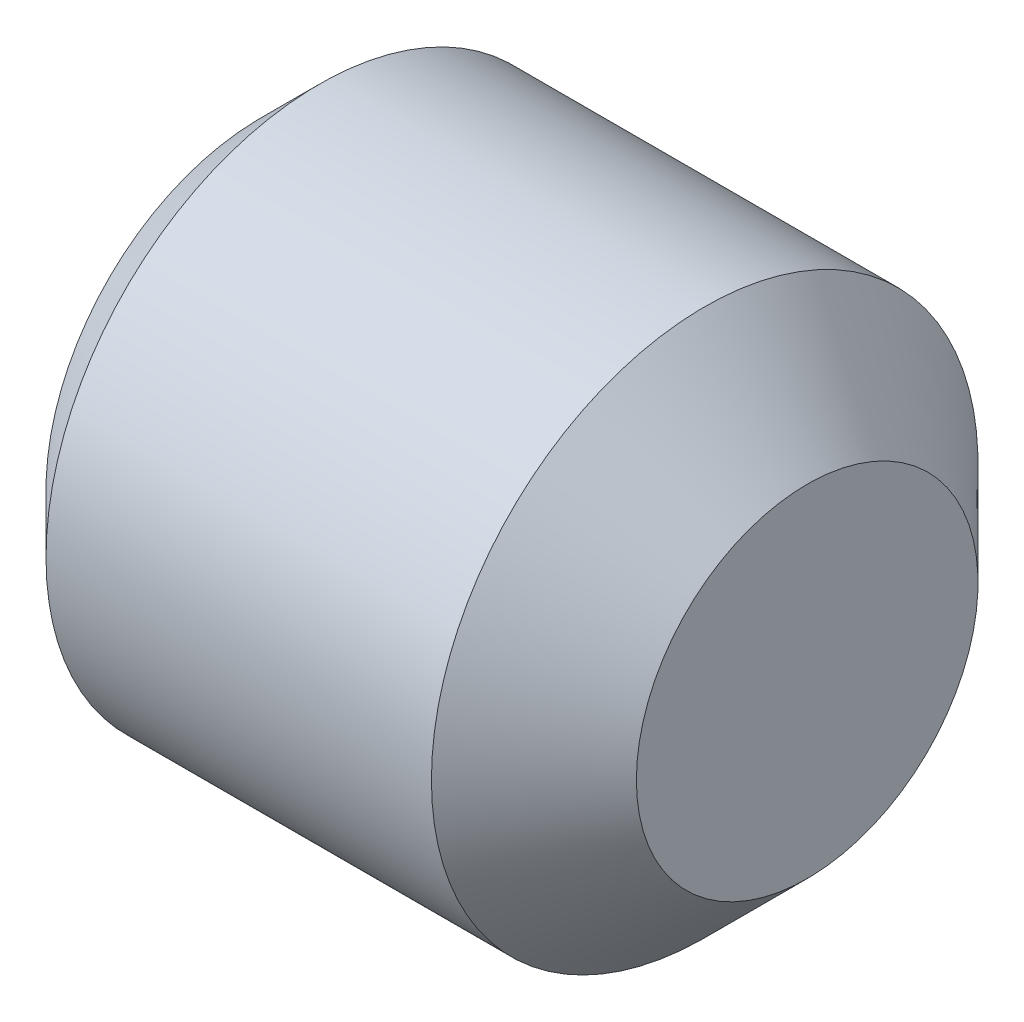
ISO-10303-21;
HEADER;
FILE_DESCRIPTION(('STEP AP214'),'2;1');
FILE_NAME('part.step','',(''),(''),'','','');
FILE_SCHEMA(('AUTOMOTIVE_DESIGN { 1 0 10303 214 1 1 1 1 }'));
ENDSEC;
DATA;
#1=APPLICATION_CONTEXT('core data for automotive mechanical design processes');
#2=APPLICATION_PROTOCOL_DEFINITION('international standard','automotive_design',2000,#1);
#3=PRODUCT_CONTEXT('',#1,'mechanical');
#4=PRODUCT('Part','Part','',(#3));
#5=PRODUCT_RELATED_PRODUCT_CATEGORY('part','',(#4));
#6=PRODUCT_DEFINITION_FORMATION('','',#4);
#7=PRODUCT_DEFINITION_CONTEXT('part definition',#1,'design');
#8=PRODUCT_DEFINITION('design','',#6,#7);
#9=PRODUCT_DEFINITION_SHAPE('','',#8);
#10=(LENGTH_UNIT() NAMED_UNIT(*) SI_UNIT(.MILLI.,.METRE.));
#11=(NAMED_UNIT(*) PLANE_ANGLE_UNIT() SI_UNIT($,.RADIAN.));
#12=(NAMED_UNIT(*) SI_UNIT($,.STERADIAN.) SOLID_ANGLE_UNIT());
#13=UNCERTAINTY_MEASURE_WITH_UNIT(LENGTH_MEASURE(1.E-05),#10,'distance_accuracy_value','');
#14=(GEOMETRIC_REPRESENTATION_CONTEXT(3) GLOBAL_UNCERTAINTY_ASSIGNED_CONTEXT((#13)) GLOBAL_UNIT_ASSIGNED_CONTEXT((#10,
#11,#12)) REPRESENTATION_CONTEXT('',''));
#15=CARTESIAN_POINT('',(0.,0.,0.));
#16=DIRECTION('',(0.,0.,1.));
#17=DIRECTION('',(1.,0.,0.));
#18=AXIS2_PLACEMENT_3D('',#15,#16,#17);
#19=CARTESIAN_POINT('',(-2.49999999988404,0.,0.));
#20=DIRECTION('',(-1.,0.,0.));
#21=DIRECTION('',(0.,0.,1.));
#22=AXIS2_PLACEMENT_3D('',#19,#20,#21);
#23=CONICAL_SURFACE('',#22,0.999999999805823,1.04719755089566);
#24=CARTESIAN_POINT('',(-1.92264973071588,0.,-1.13686837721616E-10));
#25=VERTEX_POINT('',#24);
#26=VERTEX_LOOP('',#25);
#27=FACE_BOUND('',#26,.T.);
#28=CARTESIAN_POINT('',(-2.50000000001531,0.,0.));
#29=DIRECTION('',(-1.,0.,0.));
#30=DIRECTION('',(0.,0.,1.));
#31=AXIS2_PLACEMENT_3D('',#28,#29,#30);
#32=CIRCLE('',#31,1.0000000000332);
#33=CARTESIAN_POINT('',(-2.50000000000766,0.500000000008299,-0.866025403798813));
#34=VERTEX_POINT('',#33);
#35=CARTESIAN_POINT('',(-2.50000000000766,1.0000000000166,0.));
#36=VERTEX_POINT('',#35);
#37=EDGE_CURVE('E19',#34,#36,#32,.F.);
#38=ORIENTED_EDGE('',*,*,#37,.F.);
#39=CARTESIAN_POINT('',(-2.50000000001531,0.,0.));
#40=DIRECTION('',(-1.,0.,0.));
#41=DIRECTION('',(0.,0.,1.));
#42=AXIS2_PLACEMENT_3D('',#39,#40,#41);
#43=CIRCLE('',#42,1.0000000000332);
#44=CARTESIAN_POINT('',(-2.50000000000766,-0.500000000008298,-0.866025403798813));
#45=VERTEX_POINT('',#44);
#46=EDGE_CURVE('E89',#45,#34,#43,.F.);
#47=ORIENTED_EDGE('',*,*,#46,.F.);
#48=CARTESIAN_POINT('',(-2.50000000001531,0.,0.));
#49=DIRECTION('',(-1.,0.,0.));
#50=DIRECTION('',(0.,0.,1.));
#51=AXIS2_PLACEMENT_3D('',#48,#49,#50);
#52=CIRCLE('',#51,1.0000000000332);
#53=CARTESIAN_POINT('',(-2.50000000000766,-1.0000000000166,0.));
#54=VERTEX_POINT('',#53);
#55=EDGE_CURVE('E113',#54,#45,#52,.F.);
#56=ORIENTED_EDGE('',*,*,#55,.F.);
#57=CARTESIAN_POINT('',(-2.50000000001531,0.,0.));
#58=DIRECTION('',(-1.,0.,0.));
#59=DIRECTION('',(0.,0.,1.));
#60=AXIS2_PLACEMENT_3D('',#57,#58,#59);
#61=CIRCLE('',#60,1.0000000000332);
#62=CARTESIAN_POINT('',(-2.50000000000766,-0.500000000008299,0.866025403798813));
#63=VERTEX_POINT('',#62);
#64=EDGE_CURVE('E154',#63,#54,#61,.F.);
#65=ORIENTED_EDGE('',*,*,#64,.F.);
#66=CARTESIAN_POINT('',(-2.50000000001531,0.,0.));
#67=DIRECTION('',(-1.,0.,0.));
#68=DIRECTION('',(0.,0.,1.));
#69=AXIS2_PLACEMENT_3D('',#66,#67,#68);
#70=CIRCLE('',#69,1.0000000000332);
#71=CARTESIAN_POINT('',(-2.50000000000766,0.500000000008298,0.866025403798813));
#72=VERTEX_POINT('',#71);
#73=EDGE_CURVE('E151',#72,#63,#70,.F.);
#74=ORIENTED_EDGE('',*,*,#73,.F.);
#75=CARTESIAN_POINT('',(-2.50000000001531,0.,0.));
#76=DIRECTION('',(-1.,0.,0.));
#77=DIRECTION('',(0.,0.,1.));
#78=AXIS2_PLACEMENT_3D('',#75,#76,#77);
#79=CIRCLE('',#78,1.0000000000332);
#80=EDGE_CURVE('E92',#36,#72,#79,.F.);
#81=ORIENTED_EDGE('',*,*,#80,.F.);
#82=EDGE_LOOP('',(#38,#47,#56,#65,#74,#81));
#83=FACE_BOUND('',#82,.T.);
#84=ADVANCED_FACE('F16',(#27,#83),#23,.F.);
#85=CARTESIAN_POINT('',(-2.5,0.,0.));
#86=DIRECTION('',(-1.,0.,0.));
#87=DIRECTION('',(0.,0.,1.));
#88=AXIS2_PLACEMENT_3D('',#85,#86,#87);
#89=PLANE('',#88);
#90=ORIENTED_EDGE('',*,*,#37,.T.);
#91=DIRECTION('',(0.,0.,1.));
#92=VECTOR('',#91,1.);
#93=CARTESIAN_POINT('',(-2.5,1.,0.577350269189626));
#94=LINE('',#93,#92);
#95=CARTESIAN_POINT('',(-2.5,1.,-0.577350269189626));
#96=VERTEX_POINT('',#95);
#97=EDGE_CURVE('E99',#36,#96,#94,.F.);
#98=ORIENTED_EDGE('',*,*,#97,.T.);
#99=DIRECTION('',(0.,0.866025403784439,0.5));
#100=VECTOR('',#99,1.);
#101=CARTESIAN_POINT('',(-2.5,1.,-0.577350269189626));
#102=LINE('',#101,#100);
#103=EDGE_CURVE('E97',#96,#34,#102,.F.);
#104=ORIENTED_EDGE('',*,*,#103,.T.);
#105=EDGE_LOOP('',(#90,#98,#104));
#106=FACE_BOUND('',#105,.T.);
#107=ADVANCED_FACE('F98',(#106),#89,.T.);
#108=CARTESIAN_POINT('',(-2.5,0.,0.));
#109=DIRECTION('',(-1.,0.,0.));
#110=DIRECTION('',(0.,0.,1.));
#111=AXIS2_PLACEMENT_3D('',#108,#109,#110);
#112=PLANE('',#111);
#113=ORIENTED_EDGE('',*,*,#46,.T.);
#114=DIRECTION('',(0.,0.866025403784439,0.5));
#115=VECTOR('',#114,1.);
#116=CARTESIAN_POINT('',(-2.5,1.,-0.577350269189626));
#117=LINE('',#116,#115);
#118=CARTESIAN_POINT('',(-2.5,0.,-1.15470053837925));
#119=VERTEX_POINT('',#118);
#120=EDGE_CURVE('E104',#34,#119,#117,.F.);
#121=ORIENTED_EDGE('',*,*,#120,.T.);
#122=DIRECTION('',(0.,0.866025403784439,-0.5));
#123=VECTOR('',#122,1.);
#124=CARTESIAN_POINT('',(-2.5,0.,-1.15470053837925));
#125=LINE('',#124,#123);
#126=EDGE_CURVE('E111',#119,#45,#125,.F.);
#127=ORIENTED_EDGE('',*,*,#126,.T.);
#128=EDGE_LOOP('',(#113,#121,#127));
#129=FACE_BOUND('',#128,.T.);
#130=ADVANCED_FACE('F108',(#129),#112,.T.);
#131=CARTESIAN_POINT('',(-2.5,0.,0.));
#132=DIRECTION('',(-1.,0.,0.));
#133=DIRECTION('',(0.,0.,1.));
#134=AXIS2_PLACEMENT_3D('',#131,#132,#133);
#135=PLANE('',#134);
#136=ORIENTED_EDGE('',*,*,#55,.T.);
#137=DIRECTION('',(0.,0.866025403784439,-0.5));
#138=VECTOR('',#137,1.);
#139=CARTESIAN_POINT('',(-2.5,0.,-1.15470053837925));
#140=LINE('',#139,#138);
#141=CARTESIAN_POINT('',(-2.5,-1.,-0.577350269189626));
#142=VERTEX_POINT('',#141);
#143=EDGE_CURVE('E161',#45,#142,#140,.F.);
#144=ORIENTED_EDGE('',*,*,#143,.T.);
#145=DIRECTION('',(0.,0.,-1.));
#146=VECTOR('',#145,1.);
#147=CARTESIAN_POINT('',(-2.5,-1.,-0.577350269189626));
#148=LINE('',#147,#146);
#149=EDGE_CURVE('E164',#142,#54,#148,.F.);
#150=ORIENTED_EDGE('',*,*,#149,.T.);
#151=EDGE_LOOP('',(#136,#144,#150));
#152=FACE_BOUND('',#151,.T.);
#153=ADVANCED_FACE('F160',(#152),#135,.T.);
#154=CARTESIAN_POINT('',(-2.5,0.,0.));
#155=DIRECTION('',(-1.,0.,0.));
#156=DIRECTION('',(0.,0.,1.));
#157=AXIS2_PLACEMENT_3D('',#154,#155,#156);
#158=PLANE('',#157);
#159=ORIENTED_EDGE('',*,*,#64,.T.);
#160=DIRECTION('',(0.,0.,-1.));
#161=VECTOR('',#160,1.);
#162=CARTESIAN_POINT('',(-2.5,-1.,-0.577350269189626));
#163=LINE('',#162,#161);
#164=CARTESIAN_POINT('',(-2.5,-1.,0.577350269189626));
#165=VERTEX_POINT('',#164);
#166=EDGE_CURVE('E195',#54,#165,#163,.F.);
#167=ORIENTED_EDGE('',*,*,#166,.T.);
#168=DIRECTION('',(0.,-0.866025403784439,-0.5));
#169=VECTOR('',#168,1.);
#170=CARTESIAN_POINT('',(-2.5,-1.,0.577350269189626));
#171=LINE('',#170,#169);
#172=EDGE_CURVE('E201',#165,#63,#171,.F.);
#173=ORIENTED_EDGE('',*,*,#172,.T.);
#174=EDGE_LOOP('',(#159,#167,#173));
#175=FACE_BOUND('',#174,.T.);
#176=ADVANCED_FACE('F370',(#175),#158,.T.);
#177=CARTESIAN_POINT('',(-2.5,0.,0.));
#178=DIRECTION('',(-1.,0.,0.));
#179=DIRECTION('',(0.,0.,1.));
#180=AXIS2_PLACEMENT_3D('',#177,#178,#179);
#181=PLANE('',#180);
#182=ORIENTED_EDGE('',*,*,#73,.T.);
#183=DIRECTION('',(0.,-0.866025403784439,-0.5));
#184=VECTOR('',#183,1.);
#185=CARTESIAN_POINT('',(-2.5,-1.,0.577350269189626));
#186=LINE('',#185,#184);
#187=CARTESIAN_POINT('',(-2.5,0.,1.15470053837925));
#188=VERTEX_POINT('',#187);
#189=EDGE_CURVE('E209',#63,#188,#186,.F.);
#190=ORIENTED_EDGE('',*,*,#189,.T.);
#191=DIRECTION('',(0.,-0.866025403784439,0.5));
#192=VECTOR('',#191,1.);
#193=CARTESIAN_POINT('',(-2.5,0.,1.15470053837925));
#194=LINE('',#193,#192);
#195=EDGE_CURVE('E223',#188,#72,#194,.F.);
#196=ORIENTED_EDGE('',*,*,#195,.T.);
#197=EDGE_LOOP('',(#182,#190,#196));
#198=FACE_BOUND('',#197,.T.);
#199=ADVANCED_FACE('F360',(#198),#181,.T.);
#200=CARTESIAN_POINT('',(-2.5,0.,0.));
#201=DIRECTION('',(-1.,0.,0.));
#202=DIRECTION('',(0.,0.,1.));
#203=AXIS2_PLACEMENT_3D('',#200,#201,#202);
#204=PLANE('',#203);
#205=ORIENTED_EDGE('',*,*,#80,.T.);
#206=DIRECTION('',(0.,-0.866025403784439,0.5));
#207=VECTOR('',#206,1.);
#208=CARTESIAN_POINT('',(-2.5,0.,1.15470053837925));
#209=LINE('',#208,#207);
#210=CARTESIAN_POINT('',(-2.5,1.,0.577350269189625));
#211=VERTEX_POINT('',#210);
#212=EDGE_CURVE('E228',#72,#211,#209,.F.);
#213=ORIENTED_EDGE('',*,*,#212,.T.);
#214=DIRECTION('',(0.,0.,1.));
#215=VECTOR('',#214,1.);
#216=CARTESIAN_POINT('',(-2.5,1.,0.577350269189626));
#217=LINE('',#216,#215);
#218=EDGE_CURVE('E136',#211,#36,#217,.F.);
#219=ORIENTED_EDGE('',*,*,#218,.T.);
#220=EDGE_LOOP('',(#205,#213,#219));
#221=FACE_BOUND('',#220,.T.);
#222=ADVANCED_FACE('F350',(#221),#204,.T.);
#223=CARTESIAN_POINT('',(-2.5,1.,0.577350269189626));
#224=DIRECTION('',(0.,1.,0.));
#225=DIRECTION('',(0.,0.,1.));
#226=AXIS2_PLACEMENT_3D('',#223,#224,#225);
#227=PLANE('',#226);
#228=DIRECTION('',(0.,0.,-1.));
#229=VECTOR('',#228,1.);
#230=CARTESIAN_POINT('',(-4.,1.,0.));
#231=LINE('',#230,#229);
#232=CARTESIAN_POINT('',(-4.,1.,0.577350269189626));
#233=VERTEX_POINT('',#232);
#234=CARTESIAN_POINT('',(-4.,1.,-0.577350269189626));
#235=VERTEX_POINT('',#234);
#236=EDGE_CURVE('E127',#233,#235,#231,.T.);
#237=ORIENTED_EDGE('',*,*,#236,.T.);
#238=DIRECTION('',(1.,0.,0.));
#239=VECTOR('',#238,1.);
#240=CARTESIAN_POINT('',(-2.5,1.,-0.577350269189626));
#241=LINE('',#240,#239);
#242=EDGE_CURVE('E105',#235,#96,#241,.T.);
#243=ORIENTED_EDGE('',*,*,#242,.T.);
#244=ORIENTED_EDGE('',*,*,#97,.F.);
#245=ORIENTED_EDGE('',*,*,#218,.F.);
#246=DIRECTION('',(1.,0.,0.));
#247=VECTOR('',#246,1.);
#248=CARTESIAN_POINT('',(-2.5,1.,0.577350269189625));
#249=LINE('',#248,#247);
#250=EDGE_CURVE('E140',#211,#233,#249,.F.);
#251=ORIENTED_EDGE('',*,*,#250,.T.);
#252=EDGE_LOOP('',(#237,#243,#244,#245,#251));
#253=FACE_BOUND('',#252,.T.);
#254=ADVANCED_FACE('F341',(#253),#227,.F.);
#255=CARTESIAN_POINT('',(-2.5,1.,-0.577350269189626));
#256=DIRECTION('',(0.,0.5,-0.866025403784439));
#257=DIRECTION('',(0.,0.866025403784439,0.5));
#258=AXIS2_PLACEMENT_3D('',#255,#256,#257);
#259=PLANE('',#258);
#260=DIRECTION('',(1.,0.,0.));
#261=VECTOR('',#260,1.);
#262=CARTESIAN_POINT('',(-2.5,0.,-1.15470053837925));
#263=LINE('',#262,#261);
#264=CARTESIAN_POINT('',(-4.,0.,-1.15470053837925));
#265=VERTEX_POINT('',#264);
#266=EDGE_CURVE('E116',#265,#119,#263,.T.);
#267=ORIENTED_EDGE('',*,*,#266,.T.);
#268=ORIENTED_EDGE('',*,*,#120,.F.);
#269=ORIENTED_EDGE('',*,*,#103,.F.);
#270=ORIENTED_EDGE('',*,*,#242,.F.);
#271=DIRECTION('',(0.,-0.866025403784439,-0.499999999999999));
#272=VECTOR('',#271,1.);
#273=CARTESIAN_POINT('',(-4.,1.,-0.577350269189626));
#274=LINE('',#273,#272);
#275=EDGE_CURVE('E124',#235,#265,#274,.T.);
#276=ORIENTED_EDGE('',*,*,#275,.T.);
#277=EDGE_LOOP('',(#267,#268,#269,#270,#276));
#278=FACE_BOUND('',#277,.T.);
#279=ADVANCED_FACE('F114',(#278),#259,.F.);
#280=CARTESIAN_POINT('',(-2.5,0.,-1.15470053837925));
#281=DIRECTION('',(0.,-0.5,-0.866025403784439));
#282=DIRECTION('',(0.,0.866025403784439,-0.5));
#283=AXIS2_PLACEMENT_3D('',#280,#281,#282);
#284=PLANE('',#283);
#285=DIRECTION('',(1.,0.,0.));
#286=VECTOR('',#285,1.);
#287=CARTESIAN_POINT('',(-2.5,-1.,-0.577350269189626));
#288=LINE('',#287,#286);
#289=CARTESIAN_POINT('',(-4.,-1.,-0.577350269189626));
#290=VERTEX_POINT('',#289);
#291=EDGE_CURVE('E168',#290,#142,#288,.T.);
#292=ORIENTED_EDGE('',*,*,#291,.T.);
#293=ORIENTED_EDGE('',*,*,#143,.F.);
#294=ORIENTED_EDGE('',*,*,#126,.F.);
#295=ORIENTED_EDGE('',*,*,#266,.F.);
#296=DIRECTION('',(0.,-0.866025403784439,0.499999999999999));
#297=VECTOR('',#296,1.);
#298=CARTESIAN_POINT('',(-4.,0.,-1.15470053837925));
#299=LINE('',#298,#297);
#300=EDGE_CURVE('E126',#265,#290,#299,.T.);
#301=ORIENTED_EDGE('',*,*,#300,.T.);
#302=EDGE_LOOP('',(#292,#293,#294,#295,#301));
#303=FACE_BOUND('',#302,.T.);
#304=ADVANCED_FACE('F166',(#303),#284,.F.);
#305=CARTESIAN_POINT('',(-2.5,-1.,-0.577350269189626));
#306=DIRECTION('',(0.,-1.,0.));
#307=DIRECTION('',(0.,0.,-1.));
#308=AXIS2_PLACEMENT_3D('',#305,#306,#307);
#309=PLANE('',#308);
#310=DIRECTION('',(1.,0.,0.));
#311=VECTOR('',#310,1.);
#312=CARTESIAN_POINT('',(-2.5,-1.,0.577350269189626));
#313=LINE('',#312,#311);
#314=CARTESIAN_POINT('',(-4.,-1.,0.577350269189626));
#315=VERTEX_POINT('',#314);
#316=EDGE_CURVE('E197',#315,#165,#313,.T.);
#317=ORIENTED_EDGE('',*,*,#316,.T.);
#318=ORIENTED_EDGE('',*,*,#166,.F.);
#319=ORIENTED_EDGE('',*,*,#149,.F.);
#320=ORIENTED_EDGE('',*,*,#291,.F.);
#321=DIRECTION('',(0.,0.,-1.));
#322=VECTOR('',#321,1.);
#323=CARTESIAN_POINT('',(-4.,-1.,0.));
#324=LINE('',#323,#322);
#325=EDGE_CURVE('E178',#290,#315,#324,.F.);
#326=ORIENTED_EDGE('',*,*,#325,.T.);
#327=EDGE_LOOP('',(#317,#318,#319,#320,#326));
#328=FACE_BOUND('',#327,.T.);
#329=ADVANCED_FACE('F316',(#328),#309,.F.);
#330=CARTESIAN_POINT('',(-2.5,-1.,0.577350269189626));
#331=DIRECTION('',(0.,-0.5,0.866025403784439));
#332=DIRECTION('',(0.,-0.866025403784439,-0.5));
#333=AXIS2_PLACEMENT_3D('',#330,#331,#332);
#334=PLANE('',#333);
#335=DIRECTION('',(1.,0.,0.));
#336=VECTOR('',#335,1.);
#337=CARTESIAN_POINT('',(-2.5,0.,1.15470053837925));
#338=LINE('',#337,#336);
#339=CARTESIAN_POINT('',(-4.,0.,1.15470053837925));
#340=VERTEX_POINT('',#339);
#341=EDGE_CURVE('E219',#340,#188,#338,.T.);
#342=ORIENTED_EDGE('',*,*,#341,.T.);
#343=ORIENTED_EDGE('',*,*,#189,.F.);
#344=ORIENTED_EDGE('',*,*,#172,.F.);
#345=ORIENTED_EDGE('',*,*,#316,.F.);
#346=DIRECTION('',(0.,0.866025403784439,0.499999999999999));
#347=VECTOR('',#346,1.);
#348=CARTESIAN_POINT('',(-4.,-1.,0.577350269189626));
#349=LINE('',#348,#347);
#350=EDGE_CURVE('E34',#315,#340,#349,.T.);
#351=ORIENTED_EDGE('',*,*,#350,.T.);
#352=EDGE_LOOP('',(#342,#343,#344,#345,#351));
#353=FACE_BOUND('',#352,.T.);
#354=ADVANCED_FACE('F267',(#353),#334,.F.);
#355=CARTESIAN_POINT('',(-2.5,0.,1.15470053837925));
#356=DIRECTION('',(0.,0.5,0.866025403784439));
#357=DIRECTION('',(0.,-0.866025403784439,0.5));
#358=AXIS2_PLACEMENT_3D('',#355,#356,#357);
#359=PLANE('',#358);
#360=ORIENTED_EDGE('',*,*,#250,.F.);
#361=ORIENTED_EDGE('',*,*,#212,.F.);
#362=ORIENTED_EDGE('',*,*,#195,.F.);
#363=ORIENTED_EDGE('',*,*,#341,.F.);
#364=DIRECTION('',(0.,0.866025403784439,-0.499999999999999));
#365=VECTOR('',#364,1.);
#366=CARTESIAN_POINT('',(-4.,0.,1.15470053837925));
#367=LINE('',#366,#365);
#368=EDGE_CURVE('E149',#340,#233,#367,.T.);
#369=ORIENTED_EDGE('',*,*,#368,.T.);
#370=EDGE_LOOP('',(#360,#361,#362,#363,#369));
#371=FACE_BOUND('',#370,.T.);
#372=ADVANCED_FACE('F258',(#371),#359,.F.);
#373=CARTESIAN_POINT('',(0.,1.25,0.));
#374=DIRECTION('',(-1.,0.,0.));
#375=DIRECTION('',(0.,0.,1.));
#376=AXIS2_PLACEMENT_3D('',#373,#374,#375);
#377=PLANE('',#376);
#378=CARTESIAN_POINT('',(0.,0.,0.));
#379=DIRECTION('',(-1.,0.,0.));
#380=DIRECTION('',(0.,0.,1.));
#381=AXIS2_PLACEMENT_3D('',#378,#379,#380);
#382=CIRCLE('',#381,1.24999999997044);
#383=CARTESIAN_POINT('',(0.,0.,1.24999999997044));
#384=VERTEX_POINT('',#383);
#385=EDGE_CURVE('E146',#384,#384,#382,.T.);
#386=ORIENTED_EDGE('',*,*,#385,.F.);
#387=EDGE_LOOP('',(#386));
#388=FACE_BOUND('',#387,.T.);
#389=ADVANCED_FACE('F256',(#388),#377,.F.);
#390=CARTESIAN_POINT('',(-4.,0.,0.));
#391=DIRECTION('',(1.,0.,0.));
#392=DIRECTION('',(0.,0.,-1.));
#393=AXIS2_PLACEMENT_3D('',#390,#391,#392);
#394=PLANE('',#393);
#395=ORIENTED_EDGE('',*,*,#350,.F.);
#396=ORIENTED_EDGE('',*,*,#325,.F.);
#397=ORIENTED_EDGE('',*,*,#300,.F.);
#398=ORIENTED_EDGE('',*,*,#275,.F.);
#399=ORIENTED_EDGE('',*,*,#236,.F.);
#400=ORIENTED_EDGE('',*,*,#368,.F.);
#401=EDGE_LOOP('',(#395,#396,#397,#398,#399,#400));
#402=FACE_BOUND('',#401,.T.);
#403=CARTESIAN_POINT('',(-4.0000000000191,0.,0.));
#404=DIRECTION('',(1.,0.,0.));
#405=DIRECTION('',(0.,0.,-1.));
#406=AXIS2_PLACEMENT_3D('',#403,#404,#405);
#407=CIRCLE('',#406,1.57050000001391);
#408=CARTESIAN_POINT('',(-4.0000000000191,0.,-1.57050000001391));
#409=VERTEX_POINT('',#408);
#410=EDGE_CURVE('E143',#409,#409,#407,.T.);
#411=ORIENTED_EDGE('',*,*,#410,.F.);
#412=EDGE_LOOP('',(#411));
#413=FACE_BOUND('',#412,.T.);
#414=ADVANCED_FACE('F252',(#402,#413),#394,.F.);
#415=CARTESIAN_POINT('',(-0.750000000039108,0.,0.));
#416=DIRECTION('',(-1.,0.,0.));
#417=DIRECTION('',(0.,0.,1.));
#418=AXIS2_PLACEMENT_3D('',#415,#416,#417);
#419=CONICAL_SURFACE('',#418,1.99999999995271,0.785398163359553);
#420=CARTESIAN_POINT('',(-0.75,0.,0.));
#421=DIRECTION('',(-1.,0.,0.));
#422=DIRECTION('',(0.,0.,1.));
#423=AXIS2_PLACEMENT_3D('',#420,#421,#422);
#424=CIRCLE('',#423,2.);
#425=CARTESIAN_POINT('',(-0.75,0.,2.));
#426=VERTEX_POINT('',#425);
#427=EDGE_CURVE('E25',#426,#426,#424,.T.);
#428=ORIENTED_EDGE('',*,*,#427,.F.);
#429=EDGE_LOOP('',(#428));
#430=FACE_BOUND('',#429,.T.);
#431=ORIENTED_EDGE('',*,*,#385,.T.);
#432=EDGE_LOOP('',(#431));
#433=FACE_BOUND('',#432,.T.);
#434=ADVANCED_FACE('F248',(#430,#433),#419,.T.);
#435=CARTESIAN_POINT('',(-3.5705000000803,0.,0.));
#436=DIRECTION('',(1.,0.,0.));
#437=DIRECTION('',(0.,0.,-1.));
#438=AXIS2_PLACEMENT_3D('',#435,#436,#437);
#439=CONICAL_SURFACE('',#438,1.99999999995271,0.785398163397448);
#440=ORIENTED_EDGE('',*,*,#410,.T.);
#441=EDGE_LOOP('',(#440));
#442=FACE_BOUND('',#441,.T.);
#443=CARTESIAN_POINT('',(-3.5705,0.,0.));
#444=DIRECTION('',(-1.,0.,0.));
#445=DIRECTION('',(0.,0.,1.));
#446=AXIS2_PLACEMENT_3D('',#443,#444,#445);
#447=CIRCLE('',#446,2.);
#448=CARTESIAN_POINT('',(-3.5705,0.,2.));
#449=VERTEX_POINT('',#448);
#450=EDGE_CURVE('E11',#449,#449,#447,.F.);
#451=ORIENTED_EDGE('',*,*,#450,.F.);
#452=EDGE_LOOP('',(#451));
#453=FACE_BOUND('',#452,.T.);
#454=ADVANCED_FACE('F251',(#442,#453),#439,.T.);
#455=CARTESIAN_POINT('',(0.,0.,0.));
#456=DIRECTION('',(-1.,0.,0.));
#457=DIRECTION('',(0.,0.,1.));
#458=AXIS2_PLACEMENT_3D('',#455,#456,#457);
#459=CYLINDRICAL_SURFACE('',#458,2.);
#460=ORIENTED_EDGE('',*,*,#450,.T.);
#461=EDGE_LOOP('',(#460));
#462=FACE_BOUND('',#461,.T.);
#463=ORIENTED_EDGE('',*,*,#427,.T.);
#464=EDGE_LOOP('',(#463));
#465=FACE_BOUND('',#464,.T.);
#466=ADVANCED_FACE('F246',(#462,#465),#459,.T.);
#467=CLOSED_SHELL('',(#84,#107,#130,#153,#176,#199,#222,#254,#279,#304,#329,#354,#372,#389,#414,
#434,#454,#466));
#468=MANIFOLD_SOLID_BREP('B1',#467);
#469=ADVANCED_BREP_SHAPE_REPRESENTATION('',(#18,#468),#14);
#470=SHAPE_DEFINITION_REPRESENTATION(#9,#469);
ENDSEC;
END-ISO-10303-21;
